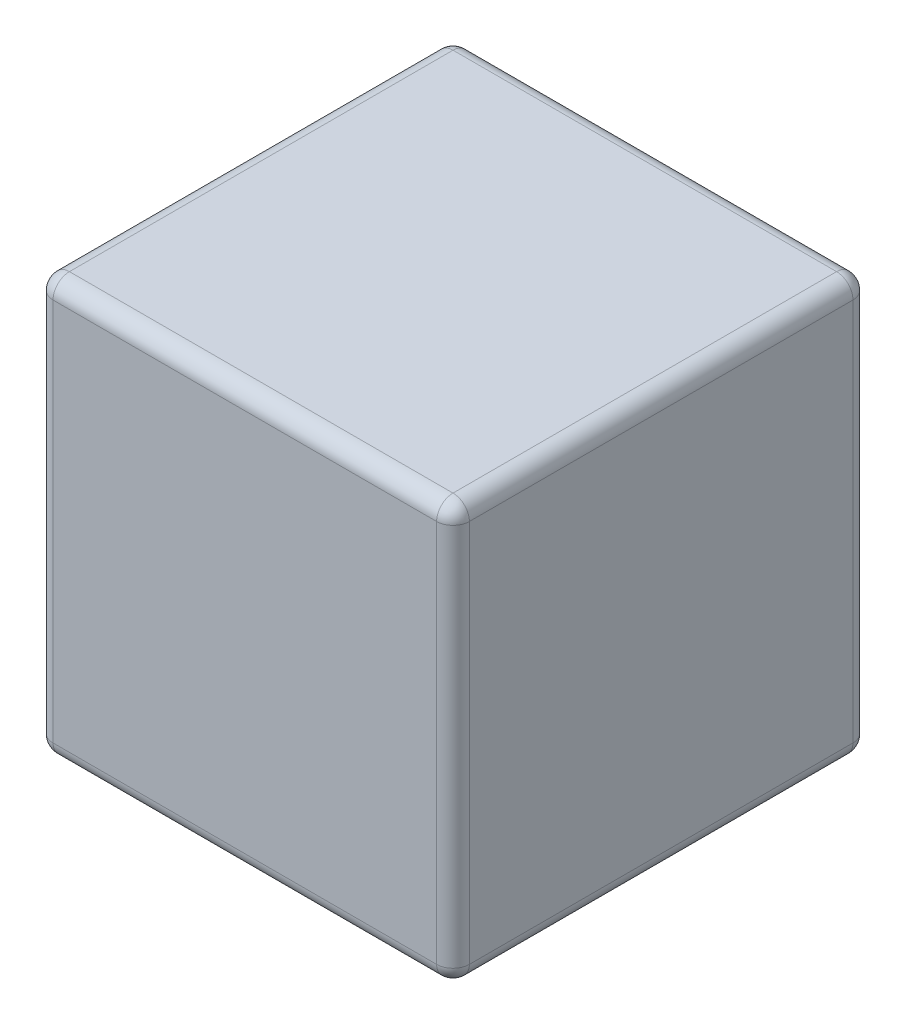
ISO-10303-21;
HEADER;
FILE_DESCRIPTION(('STEP AP214'),'2;1');
FILE_NAME('part.step','',(''),(''),'','','');
FILE_SCHEMA(('AUTOMOTIVE_DESIGN { 1 0 10303 214 1 1 1 1 }'));
ENDSEC;
DATA;
#1=APPLICATION_CONTEXT('core data for automotive mechanical design processes');
#2=APPLICATION_PROTOCOL_DEFINITION('international standard','automotive_design',2000,#1);
#3=PRODUCT_CONTEXT('',#1,'mechanical');
#4=PRODUCT('Part','Part','',(#3));
#5=PRODUCT_RELATED_PRODUCT_CATEGORY('part','',(#4));
#6=PRODUCT_DEFINITION_FORMATION('','',#4);
#7=PRODUCT_DEFINITION_CONTEXT('part definition',#1,'design');
#8=PRODUCT_DEFINITION('design','',#6,#7);
#9=PRODUCT_DEFINITION_SHAPE('','',#8);
#10=(LENGTH_UNIT() NAMED_UNIT(*) SI_UNIT(.MILLI.,.METRE.));
#11=(NAMED_UNIT(*) PLANE_ANGLE_UNIT() SI_UNIT($,.RADIAN.));
#12=(NAMED_UNIT(*) SI_UNIT($,.STERADIAN.) SOLID_ANGLE_UNIT());
#13=UNCERTAINTY_MEASURE_WITH_UNIT(LENGTH_MEASURE(1.E-05),#10,'distance_accuracy_value','');
#14=(GEOMETRIC_REPRESENTATION_CONTEXT(3) GLOBAL_UNCERTAINTY_ASSIGNED_CONTEXT((#13)) GLOBAL_UNIT_ASSIGNED_CONTEXT((#10,
#11,#12)) REPRESENTATION_CONTEXT('',''));
#15=CARTESIAN_POINT('',(0.,0.,0.));
#16=DIRECTION('',(0.,0.,1.));
#17=DIRECTION('',(1.,0.,0.));
#18=AXIS2_PLACEMENT_3D('',#15,#16,#17);
#19=CARTESIAN_POINT('',(12.7,25.4,12.7));
#20=DIRECTION('',(-1.,0.,0.));
#21=DIRECTION('',(0.,0.,1.));
#22=AXIS2_PLACEMENT_3D('',#19,#20,#21);
#23=PLANE('',#22);
#24=DIRECTION('',(0.,-1.,0.));
#25=VECTOR('',#24,1.);
#26=CARTESIAN_POINT('',(12.7,25.4,11.7));
#27=LINE('',#26,#25);
#28=CARTESIAN_POINT('',(12.7,24.4,11.7));
#29=VERTEX_POINT('',#28);
#30=CARTESIAN_POINT('',(12.7,1.,11.7));
#31=VERTEX_POINT('',#30);
#32=EDGE_CURVE('E135',#29,#31,#27,.T.);
#33=ORIENTED_EDGE('',*,*,#32,.T.);
#34=DIRECTION('',(0.,0.,-1.));
#35=VECTOR('',#34,1.);
#36=CARTESIAN_POINT('',(12.7,1.,-12.7));
#37=LINE('',#36,#35);
#38=CARTESIAN_POINT('',(12.7,1.,-11.7));
#39=VERTEX_POINT('',#38);
#40=EDGE_CURVE('E177',#31,#39,#37,.T.);
#41=ORIENTED_EDGE('',*,*,#40,.T.);
#42=DIRECTION('',(0.,-1.,0.));
#43=VECTOR('',#42,1.);
#44=CARTESIAN_POINT('',(12.7,25.4,-11.7));
#45=LINE('',#44,#43);
#46=CARTESIAN_POINT('',(12.7,24.4,-11.7));
#47=VERTEX_POINT('',#46);
#48=EDGE_CURVE('E138',#39,#47,#45,.F.);
#49=ORIENTED_EDGE('',*,*,#48,.T.);
#50=DIRECTION('',(0.,0.,-1.));
#51=VECTOR('',#50,1.);
#52=CARTESIAN_POINT('',(12.7,24.4,12.7));
#53=LINE('',#52,#51);
#54=EDGE_CURVE('E131',#47,#29,#53,.F.);
#55=ORIENTED_EDGE('',*,*,#54,.T.);
#56=EDGE_LOOP('',(#33,#41,#49,#55));
#57=FACE_BOUND('',#56,.T.);
#58=ADVANCED_FACE('F43',(#57),#23,.F.);
#59=CARTESIAN_POINT('',(-12.7,25.4,-12.7));
#60=DIRECTION('',(0.,0.,1.));
#61=DIRECTION('',(1.,0.,0.));
#62=AXIS2_PLACEMENT_3D('',#59,#60,#61);
#63=PLANE('',#62);
#64=DIRECTION('',(-1.,0.,0.));
#65=VECTOR('',#64,1.);
#66=CARTESIAN_POINT('',(-12.7,24.4,-12.7));
#67=LINE('',#66,#65);
#68=CARTESIAN_POINT('',(-11.7,24.4,-12.7));
#69=VERTEX_POINT('',#68);
#70=CARTESIAN_POINT('',(11.7,24.4,-12.7));
#71=VERTEX_POINT('',#70);
#72=EDGE_CURVE('E193',#69,#71,#67,.F.);
#73=ORIENTED_EDGE('',*,*,#72,.T.);
#74=DIRECTION('',(0.,-1.,0.));
#75=VECTOR('',#74,1.);
#76=CARTESIAN_POINT('',(11.7,25.4,-12.7));
#77=LINE('',#76,#75);
#78=CARTESIAN_POINT('',(11.7,1.,-12.7));
#79=VERTEX_POINT('',#78);
#80=EDGE_CURVE('E202',#71,#79,#77,.T.);
#81=ORIENTED_EDGE('',*,*,#80,.T.);
#82=DIRECTION('',(-1.,0.,0.));
#83=VECTOR('',#82,1.);
#84=CARTESIAN_POINT('',(-12.7,1.,-12.7));
#85=LINE('',#84,#83);
#86=CARTESIAN_POINT('',(-11.7,1.,-12.7));
#87=VERTEX_POINT('',#86);
#88=EDGE_CURVE('E199',#79,#87,#85,.T.);
#89=ORIENTED_EDGE('',*,*,#88,.T.);
#90=DIRECTION('',(0.,-1.,0.));
#91=VECTOR('',#90,1.);
#92=CARTESIAN_POINT('',(-11.7,25.4,-12.7));
#93=LINE('',#92,#91);
#94=EDGE_CURVE('E196',#87,#69,#93,.F.);
#95=ORIENTED_EDGE('',*,*,#94,.T.);
#96=EDGE_LOOP('',(#73,#81,#89,#95));
#97=FACE_BOUND('',#96,.T.);
#98=ADVANCED_FACE('F322',(#97),#63,.F.);
#99=CARTESIAN_POINT('',(-12.7,25.4,12.7));
#100=DIRECTION('',(1.,0.,0.));
#101=DIRECTION('',(0.,0.,-1.));
#102=AXIS2_PLACEMENT_3D('',#99,#100,#101);
#103=PLANE('',#102);
#104=DIRECTION('',(0.,0.,1.));
#105=VECTOR('',#104,1.);
#106=CARTESIAN_POINT('',(-12.7,24.4,12.7));
#107=LINE('',#106,#105);
#108=CARTESIAN_POINT('',(-12.7,24.4,11.7));
#109=VERTEX_POINT('',#108);
#110=CARTESIAN_POINT('',(-12.7,24.4,-11.7));
#111=VERTEX_POINT('',#110);
#112=EDGE_CURVE('E209',#109,#111,#107,.F.);
#113=ORIENTED_EDGE('',*,*,#112,.T.);
#114=DIRECTION('',(0.,-1.,0.));
#115=VECTOR('',#114,1.);
#116=CARTESIAN_POINT('',(-12.7,25.4,-11.7));
#117=LINE('',#116,#115);
#118=CARTESIAN_POINT('',(-12.7,1.,-11.7));
#119=VERTEX_POINT('',#118);
#120=EDGE_CURVE('E215',#111,#119,#117,.T.);
#121=ORIENTED_EDGE('',*,*,#120,.T.);
#122=DIRECTION('',(0.,0.,1.));
#123=VECTOR('',#122,1.);
#124=CARTESIAN_POINT('',(-12.7,1.,12.7));
#125=LINE('',#124,#123);
#126=CARTESIAN_POINT('',(-12.7,1.,11.7));
#127=VERTEX_POINT('',#126);
#128=EDGE_CURVE('E212',#119,#127,#125,.T.);
#129=ORIENTED_EDGE('',*,*,#128,.T.);
#130=DIRECTION('',(0.,-1.,0.));
#131=VECTOR('',#130,1.);
#132=CARTESIAN_POINT('',(-12.7,25.4,11.7));
#133=LINE('',#132,#131);
#134=EDGE_CURVE('E206',#127,#109,#133,.F.);
#135=ORIENTED_EDGE('',*,*,#134,.T.);
#136=EDGE_LOOP('',(#113,#121,#129,#135));
#137=FACE_BOUND('',#136,.T.);
#138=ADVANCED_FACE('F331',(#137),#103,.F.);
#139=CARTESIAN_POINT('',(-12.7,25.4,12.7));
#140=DIRECTION('',(0.,0.,-1.));
#141=DIRECTION('',(-1.,0.,0.));
#142=AXIS2_PLACEMENT_3D('',#139,#140,#141);
#143=PLANE('',#142);
#144=DIRECTION('',(1.,0.,0.));
#145=VECTOR('',#144,1.);
#146=CARTESIAN_POINT('',(-12.7,24.4,12.7));
#147=LINE('',#146,#145);
#148=CARTESIAN_POINT('',(11.7,24.4,12.7));
#149=VERTEX_POINT('',#148);
#150=CARTESIAN_POINT('',(-11.7,24.4,12.7));
#151=VERTEX_POINT('',#150);
#152=EDGE_CURVE('E53',#149,#151,#147,.F.);
#153=ORIENTED_EDGE('',*,*,#152,.T.);
#154=DIRECTION('',(0.,-1.,0.));
#155=VECTOR('',#154,1.);
#156=CARTESIAN_POINT('',(-11.7,25.4,12.7));
#157=LINE('',#156,#155);
#158=CARTESIAN_POINT('',(-11.7,1.,12.7));
#159=VERTEX_POINT('',#158);
#160=EDGE_CURVE('E11',#151,#159,#157,.T.);
#161=ORIENTED_EDGE('',*,*,#160,.T.);
#162=DIRECTION('',(1.,0.,0.));
#163=VECTOR('',#162,1.);
#164=CARTESIAN_POINT('',(12.7,1.,12.7));
#165=LINE('',#164,#163);
#166=CARTESIAN_POINT('',(11.7,1.,12.7));
#167=VERTEX_POINT('',#166);
#168=EDGE_CURVE('E231',#159,#167,#165,.T.);
#169=ORIENTED_EDGE('',*,*,#168,.T.);
#170=DIRECTION('',(0.,-1.,0.));
#171=VECTOR('',#170,1.);
#172=CARTESIAN_POINT('',(11.7,25.4,12.7));
#173=LINE('',#172,#171);
#174=EDGE_CURVE('E64',#167,#149,#173,.F.);
#175=ORIENTED_EDGE('',*,*,#174,.T.);
#176=EDGE_LOOP('',(#153,#161,#169,#175));
#177=FACE_BOUND('',#176,.T.);
#178=ADVANCED_FACE('F343',(#177),#143,.F.);
#179=CARTESIAN_POINT('',(0.,25.4,0.));
#180=DIRECTION('',(0.,-1.,0.));
#181=DIRECTION('',(0.,0.,-1.));
#182=AXIS2_PLACEMENT_3D('',#179,#180,#181);
#183=PLANE('',#182);
#184=DIRECTION('',(-1.,0.,0.));
#185=VECTOR('',#184,1.);
#186=CARTESIAN_POINT('',(0.,25.4,-11.7));
#187=LINE('',#186,#185);
#188=CARTESIAN_POINT('',(11.7,25.4,-11.7));
#189=VERTEX_POINT('',#188);
#190=CARTESIAN_POINT('',(-11.7,25.4,-11.7));
#191=VERTEX_POINT('',#190);
#192=EDGE_CURVE('E224',#189,#191,#187,.T.);
#193=ORIENTED_EDGE('',*,*,#192,.T.);
#194=DIRECTION('',(0.,0.,1.));
#195=VECTOR('',#194,1.);
#196=CARTESIAN_POINT('',(-11.7,25.4,0.));
#197=LINE('',#196,#195);
#198=CARTESIAN_POINT('',(-11.7,25.4,11.7));
#199=VERTEX_POINT('',#198);
#200=EDGE_CURVE('E227',#191,#199,#197,.T.);
#201=ORIENTED_EDGE('',*,*,#200,.T.);
#202=DIRECTION('',(1.,0.,0.));
#203=VECTOR('',#202,1.);
#204=CARTESIAN_POINT('',(0.,25.4,11.7));
#205=LINE('',#204,#203);
#206=CARTESIAN_POINT('',(11.7,25.4,11.7));
#207=VERTEX_POINT('',#206);
#208=EDGE_CURVE('E219',#199,#207,#205,.T.);
#209=ORIENTED_EDGE('',*,*,#208,.T.);
#210=DIRECTION('',(0.,0.,-1.));
#211=VECTOR('',#210,1.);
#212=CARTESIAN_POINT('',(11.7,25.4,0.));
#213=LINE('',#212,#211);
#214=EDGE_CURVE('E149',#207,#189,#213,.T.);
#215=ORIENTED_EDGE('',*,*,#214,.T.);
#216=EDGE_LOOP('',(#193,#201,#209,#215));
#217=FACE_BOUND('',#216,.T.);
#218=ADVANCED_FACE('F576',(#217),#183,.F.);
#219=CARTESIAN_POINT('',(0.,0.,0.));
#220=DIRECTION('',(0.,-1.,0.));
#221=DIRECTION('',(0.,0.,-1.));
#222=AXIS2_PLACEMENT_3D('',#219,#220,#221);
#223=PLANE('',#222);
#224=DIRECTION('',(-1.,0.,0.));
#225=VECTOR('',#224,1.);
#226=CARTESIAN_POINT('',(12.7,0.,-11.7));
#227=LINE('',#226,#225);
#228=CARTESIAN_POINT('',(-11.7,0.,-11.7));
#229=VERTEX_POINT('',#228);
#230=CARTESIAN_POINT('',(11.7,0.,-11.7));
#231=VERTEX_POINT('',#230);
#232=EDGE_CURVE('E186',#229,#231,#227,.F.);
#233=ORIENTED_EDGE('',*,*,#232,.T.);
#234=DIRECTION('',(0.,0.,-1.));
#235=VECTOR('',#234,1.);
#236=CARTESIAN_POINT('',(11.7,0.,12.7));
#237=LINE('',#236,#235);
#238=CARTESIAN_POINT('',(11.7,0.,11.7));
#239=VERTEX_POINT('',#238);
#240=EDGE_CURVE('E189',#231,#239,#237,.F.);
#241=ORIENTED_EDGE('',*,*,#240,.T.);
#242=DIRECTION('',(1.,0.,0.));
#243=VECTOR('',#242,1.);
#244=CARTESIAN_POINT('',(-12.7,0.,11.7));
#245=LINE('',#244,#243);
#246=CARTESIAN_POINT('',(-11.7,0.,11.7));
#247=VERTEX_POINT('',#246);
#248=EDGE_CURVE('E180',#239,#247,#245,.F.);
#249=ORIENTED_EDGE('',*,*,#248,.T.);
#250=DIRECTION('',(0.,0.,1.));
#251=VECTOR('',#250,1.);
#252=CARTESIAN_POINT('',(-11.7,0.,-12.7));
#253=LINE('',#252,#251);
#254=EDGE_CURVE('E183',#247,#229,#253,.F.);
#255=ORIENTED_EDGE('',*,*,#254,.T.);
#256=EDGE_LOOP('',(#233,#241,#249,#255));
#257=FACE_BOUND('',#256,.T.);
#258=ADVANCED_FACE('F567',(#257),#223,.T.);
#259=CARTESIAN_POINT('',(-11.7,24.4,0.));
#260=DIRECTION('',(0.,0.,1.));
#261=DIRECTION('',(1.,0.,0.));
#262=AXIS2_PLACEMENT_3D('',#259,#260,#261);
#263=CYLINDRICAL_SURFACE('',#262,1.);
#264=CARTESIAN_POINT('',(-11.7,24.4,11.7));
#265=DIRECTION('',(0.,0.,1.));
#266=DIRECTION('',(1.,0.,0.));
#267=AXIS2_PLACEMENT_3D('',#264,#265,#266);
#268=CIRCLE('',#267,1.);
#269=EDGE_CURVE('E47',#199,#109,#268,.T.);
#270=ORIENTED_EDGE('',*,*,#269,.F.);
#271=ORIENTED_EDGE('',*,*,#200,.F.);
#272=CARTESIAN_POINT('',(-11.7,24.4,-11.7));
#273=DIRECTION('',(0.,0.,-1.));
#274=DIRECTION('',(-1.,0.,0.));
#275=AXIS2_PLACEMENT_3D('',#272,#273,#274);
#276=CIRCLE('',#275,1.);
#277=EDGE_CURVE('E173',#111,#191,#276,.T.);
#278=ORIENTED_EDGE('',*,*,#277,.F.);
#279=ORIENTED_EDGE('',*,*,#112,.F.);
#280=EDGE_LOOP('',(#270,#271,#278,#279));
#281=FACE_BOUND('',#280,.T.);
#282=ADVANCED_FACE('F45',(#281),#263,.T.);
#283=CARTESIAN_POINT('',(-11.7,24.4,11.7));
#284=DIRECTION('',(-1.,0.,0.));
#285=DIRECTION('',(0.,0.,1.));
#286=AXIS2_PLACEMENT_3D('',#283,#284,#285);
#287=SPHERICAL_SURFACE('',#286,1.);
#288=CARTESIAN_POINT('',(-11.7,24.4,11.7));
#289=DIRECTION('',(-1.,0.,0.));
#290=DIRECTION('',(0.,0.,1.));
#291=AXIS2_PLACEMENT_3D('',#288,#289,#290);
#292=CIRCLE('',#291,1.);
#293=EDGE_CURVE('E298',#199,#151,#292,.F.);
#294=ORIENTED_EDGE('',*,*,#293,.F.);
#295=ORIENTED_EDGE('',*,*,#269,.T.);
#296=CARTESIAN_POINT('',(-11.7,24.4,11.7));
#297=DIRECTION('',(0.,1.,0.));
#298=DIRECTION('',(0.,0.,1.));
#299=AXIS2_PLACEMENT_3D('',#296,#297,#298);
#300=CIRCLE('',#299,1.);
#301=EDGE_CURVE('E301',#151,#109,#300,.F.);
#302=ORIENTED_EDGE('',*,*,#301,.F.);
#303=EDGE_LOOP('',(#294,#295,#302));
#304=FACE_BOUND('',#303,.T.);
#305=ADVANCED_FACE('F337',(#304),#287,.T.);
#306=CARTESIAN_POINT('',(-11.7,24.4,-11.7));
#307=DIRECTION('',(0.,1.,0.));
#308=DIRECTION('',(0.,0.,1.));
#309=AXIS2_PLACEMENT_3D('',#306,#307,#308);
#310=SPHERICAL_SURFACE('',#309,1.);
#311=CARTESIAN_POINT('',(-11.7,24.4,-11.7));
#312=DIRECTION('',(0.,1.,0.));
#313=DIRECTION('',(0.,0.,1.));
#314=AXIS2_PLACEMENT_3D('',#311,#312,#313);
#315=CIRCLE('',#314,1.);
#316=EDGE_CURVE('E290',#111,#69,#315,.F.);
#317=ORIENTED_EDGE('',*,*,#316,.F.);
#318=ORIENTED_EDGE('',*,*,#277,.T.);
#319=CARTESIAN_POINT('',(-11.7,24.4,-11.7));
#320=DIRECTION('',(-1.,0.,0.));
#321=DIRECTION('',(0.,0.,1.));
#322=AXIS2_PLACEMENT_3D('',#319,#320,#321);
#323=CIRCLE('',#322,1.);
#324=EDGE_CURVE('E294',#69,#191,#323,.F.);
#325=ORIENTED_EDGE('',*,*,#324,.F.);
#326=EDGE_LOOP('',(#317,#318,#325));
#327=FACE_BOUND('',#326,.T.);
#328=ADVANCED_FACE('F310',(#327),#310,.T.);
#329=CARTESIAN_POINT('',(-11.7,25.4,11.7));
#330=DIRECTION('',(0.,-1.,0.));
#331=DIRECTION('',(0.,0.,-1.));
#332=AXIS2_PLACEMENT_3D('',#329,#330,#331);
#333=CYLINDRICAL_SURFACE('',#332,1.);
#334=ORIENTED_EDGE('',*,*,#301,.T.);
#335=ORIENTED_EDGE('',*,*,#134,.F.);
#336=CARTESIAN_POINT('',(-11.7,1.,11.7));
#337=DIRECTION('',(0.,-1.,0.));
#338=DIRECTION('',(0.,0.,-1.));
#339=AXIS2_PLACEMENT_3D('',#336,#337,#338);
#340=CIRCLE('',#339,1.);
#341=EDGE_CURVE('E282',#159,#127,#340,.T.);
#342=ORIENTED_EDGE('',*,*,#341,.F.);
#343=ORIENTED_EDGE('',*,*,#160,.F.);
#344=EDGE_LOOP('',(#334,#335,#342,#343));
#345=FACE_BOUND('',#344,.T.);
#346=ADVANCED_FACE('F340',(#345),#333,.T.);
#347=CARTESIAN_POINT('',(0.,24.4,11.7));
#348=DIRECTION('',(1.,0.,0.));
#349=DIRECTION('',(0.,0.,-1.));
#350=AXIS2_PLACEMENT_3D('',#347,#348,#349);
#351=CYLINDRICAL_SURFACE('',#350,1.);
#352=ORIENTED_EDGE('',*,*,#293,.T.);
#353=ORIENTED_EDGE('',*,*,#152,.F.);
#354=CARTESIAN_POINT('',(11.7,24.4,11.7));
#355=DIRECTION('',(1.,0.,0.));
#356=DIRECTION('',(0.,0.,-1.));
#357=AXIS2_PLACEMENT_3D('',#354,#355,#356);
#358=CIRCLE('',#357,1.);
#359=EDGE_CURVE('E154',#207,#149,#358,.T.);
#360=ORIENTED_EDGE('',*,*,#359,.F.);
#361=ORIENTED_EDGE('',*,*,#208,.F.);
#362=EDGE_LOOP('',(#352,#353,#360,#361));
#363=FACE_BOUND('',#362,.T.);
#364=ADVANCED_FACE('F521',(#363),#351,.T.);
#365=CARTESIAN_POINT('',(11.7,24.4,0.));
#366=DIRECTION('',(0.,0.,-1.));
#367=DIRECTION('',(-1.,0.,0.));
#368=AXIS2_PLACEMENT_3D('',#365,#366,#367);
#369=CYLINDRICAL_SURFACE('',#368,1.);
#370=CARTESIAN_POINT('',(11.7,24.4,-11.7));
#371=DIRECTION('',(0.,0.,-1.));
#372=DIRECTION('',(-1.,0.,0.));
#373=AXIS2_PLACEMENT_3D('',#370,#371,#372);
#374=CIRCLE('',#373,1.);
#375=EDGE_CURVE('E155',#189,#47,#374,.T.);
#376=ORIENTED_EDGE('',*,*,#375,.F.);
#377=ORIENTED_EDGE('',*,*,#214,.F.);
#378=CARTESIAN_POINT('',(11.7,24.4,11.7));
#379=DIRECTION('',(0.,0.,1.));
#380=DIRECTION('',(1.,0.,0.));
#381=AXIS2_PLACEMENT_3D('',#378,#379,#380);
#382=CIRCLE('',#381,1.);
#383=EDGE_CURVE('E146',#29,#207,#382,.T.);
#384=ORIENTED_EDGE('',*,*,#383,.F.);
#385=ORIENTED_EDGE('',*,*,#54,.F.);
#386=EDGE_LOOP('',(#376,#377,#384,#385));
#387=FACE_BOUND('',#386,.T.);
#388=ADVANCED_FACE('F148',(#387),#369,.T.);
#389=CARTESIAN_POINT('',(0.,24.4,-11.7));
#390=DIRECTION('',(-1.,0.,0.));
#391=DIRECTION('',(0.,0.,1.));
#392=AXIS2_PLACEMENT_3D('',#389,#390,#391);
#393=CYLINDRICAL_SURFACE('',#392,1.);
#394=ORIENTED_EDGE('',*,*,#324,.T.);
#395=ORIENTED_EDGE('',*,*,#192,.F.);
#396=CARTESIAN_POINT('',(11.7,24.4,-11.7));
#397=DIRECTION('',(1.,0.,0.));
#398=DIRECTION('',(0.,0.,-1.));
#399=AXIS2_PLACEMENT_3D('',#396,#397,#398);
#400=CIRCLE('',#399,1.);
#401=EDGE_CURVE('E274',#71,#189,#400,.T.);
#402=ORIENTED_EDGE('',*,*,#401,.F.);
#403=ORIENTED_EDGE('',*,*,#72,.F.);
#404=EDGE_LOOP('',(#394,#395,#402,#403));
#405=FACE_BOUND('',#404,.T.);
#406=ADVANCED_FACE('F318',(#405),#393,.T.);
#407=CARTESIAN_POINT('',(-11.7,25.4,-11.7));
#408=DIRECTION('',(0.,-1.,0.));
#409=DIRECTION('',(0.,0.,-1.));
#410=AXIS2_PLACEMENT_3D('',#407,#408,#409);
#411=CYLINDRICAL_SURFACE('',#410,1.);
#412=ORIENTED_EDGE('',*,*,#316,.T.);
#413=ORIENTED_EDGE('',*,*,#94,.F.);
#414=CARTESIAN_POINT('',(-11.7,1.,-11.7));
#415=DIRECTION('',(0.,-1.,0.));
#416=DIRECTION('',(0.,0.,-1.));
#417=AXIS2_PLACEMENT_3D('',#414,#415,#416);
#418=CIRCLE('',#417,1.);
#419=EDGE_CURVE('E270',#119,#87,#418,.T.);
#420=ORIENTED_EDGE('',*,*,#419,.F.);
#421=ORIENTED_EDGE('',*,*,#120,.F.);
#422=EDGE_LOOP('',(#412,#413,#420,#421));
#423=FACE_BOUND('',#422,.T.);
#424=ADVANCED_FACE('F328',(#423),#411,.T.);
#425=CARTESIAN_POINT('',(-11.7,1.,12.7));
#426=DIRECTION('',(0.,0.,-1.));
#427=DIRECTION('',(-1.,0.,0.));
#428=AXIS2_PLACEMENT_3D('',#425,#426,#427);
#429=CYLINDRICAL_SURFACE('',#428,1.);
#430=CARTESIAN_POINT('',(-11.7,1.,11.7));
#431=DIRECTION('',(0.,0.,1.));
#432=DIRECTION('',(1.,0.,0.));
#433=AXIS2_PLACEMENT_3D('',#430,#431,#432);
#434=CIRCLE('',#433,1.);
#435=EDGE_CURVE('E286',#127,#247,#434,.T.);
#436=ORIENTED_EDGE('',*,*,#435,.F.);
#437=ORIENTED_EDGE('',*,*,#128,.F.);
#438=CARTESIAN_POINT('',(-11.7,1.,-11.7));
#439=DIRECTION('',(0.,0.,-1.));
#440=DIRECTION('',(-1.,0.,0.));
#441=AXIS2_PLACEMENT_3D('',#438,#439,#440);
#442=CIRCLE('',#441,1.);
#443=EDGE_CURVE('E267',#229,#119,#442,.T.);
#444=ORIENTED_EDGE('',*,*,#443,.F.);
#445=ORIENTED_EDGE('',*,*,#254,.F.);
#446=EDGE_LOOP('',(#436,#437,#444,#445));
#447=FACE_BOUND('',#446,.T.);
#448=ADVANCED_FACE('F482',(#447),#429,.T.);
#449=CARTESIAN_POINT('',(-11.7,1.,11.7));
#450=DIRECTION('',(-1.,0.,0.));
#451=DIRECTION('',(0.,-1.,0.));
#452=AXIS2_PLACEMENT_3D('',#449,#450,#451);
#453=SPHERICAL_SURFACE('',#452,1.);
#454=ORIENTED_EDGE('',*,*,#341,.T.);
#455=ORIENTED_EDGE('',*,*,#435,.T.);
#456=CARTESIAN_POINT('',(-11.7,1.,11.7));
#457=DIRECTION('',(-1.,0.,0.));
#458=DIRECTION('',(0.,0.,1.));
#459=AXIS2_PLACEMENT_3D('',#456,#457,#458);
#460=CIRCLE('',#459,1.);
#461=EDGE_CURVE('E162',#159,#247,#460,.F.);
#462=ORIENTED_EDGE('',*,*,#461,.F.);
#463=EDGE_LOOP('',(#454,#455,#462));
#464=FACE_BOUND('',#463,.T.);
#465=ADVANCED_FACE('F373',(#464),#453,.T.);
#466=CARTESIAN_POINT('',(11.7,24.4,11.7));
#467=DIRECTION('',(0.,1.,0.));
#468=DIRECTION('',(0.,0.,1.));
#469=AXIS2_PLACEMENT_3D('',#466,#467,#468);
#470=SPHERICAL_SURFACE('',#469,1.);
#471=ORIENTED_EDGE('',*,*,#383,.T.);
#472=ORIENTED_EDGE('',*,*,#359,.T.);
#473=CARTESIAN_POINT('',(11.7,24.4,11.7));
#474=DIRECTION('',(0.,1.,0.));
#475=DIRECTION('',(0.,0.,1.));
#476=AXIS2_PLACEMENT_3D('',#473,#474,#475);
#477=CIRCLE('',#476,1.);
#478=EDGE_CURVE('E158',#29,#149,#477,.F.);
#479=ORIENTED_EDGE('',*,*,#478,.F.);
#480=EDGE_LOOP('',(#471,#472,#479));
#481=FACE_BOUND('',#480,.T.);
#482=ADVANCED_FACE('F159',(#481),#470,.T.);
#483=CARTESIAN_POINT('',(11.7,24.4,-11.7));
#484=DIRECTION('',(0.,1.,0.));
#485=DIRECTION('',(0.,0.,1.));
#486=AXIS2_PLACEMENT_3D('',#483,#484,#485);
#487=SPHERICAL_SURFACE('',#486,1.);
#488=ORIENTED_EDGE('',*,*,#401,.T.);
#489=ORIENTED_EDGE('',*,*,#375,.T.);
#490=CARTESIAN_POINT('',(11.7,24.4,-11.7));
#491=DIRECTION('',(0.,1.,0.));
#492=DIRECTION('',(0.,0.,1.));
#493=AXIS2_PLACEMENT_3D('',#490,#491,#492);
#494=CIRCLE('',#493,1.);
#495=EDGE_CURVE('E163',#71,#47,#494,.F.);
#496=ORIENTED_EDGE('',*,*,#495,.F.);
#497=EDGE_LOOP('',(#488,#489,#496));
#498=FACE_BOUND('',#497,.T.);
#499=ADVANCED_FACE('F363',(#498),#487,.T.);
#500=CARTESIAN_POINT('',(-11.7,1.,-11.7));
#501=DIRECTION('',(-1.,0.,0.));
#502=DIRECTION('',(0.,-1.,0.));
#503=AXIS2_PLACEMENT_3D('',#500,#501,#502);
#504=SPHERICAL_SURFACE('',#503,1.);
#505=ORIENTED_EDGE('',*,*,#443,.T.);
#506=ORIENTED_EDGE('',*,*,#419,.T.);
#507=CARTESIAN_POINT('',(-11.7,1.,-11.7));
#508=DIRECTION('',(-1.,0.,0.));
#509=DIRECTION('',(0.,0.,1.));
#510=AXIS2_PLACEMENT_3D('',#507,#508,#509);
#511=CIRCLE('',#510,1.);
#512=EDGE_CURVE('E257',#229,#87,#511,.F.);
#513=ORIENTED_EDGE('',*,*,#512,.F.);
#514=EDGE_LOOP('',(#505,#506,#513));
#515=FACE_BOUND('',#514,.T.);
#516=ADVANCED_FACE('F365',(#515),#504,.T.);
#517=CARTESIAN_POINT('',(-12.7,1.,11.7));
#518=DIRECTION('',(-1.,0.,0.));
#519=DIRECTION('',(0.,0.,1.));
#520=AXIS2_PLACEMENT_3D('',#517,#518,#519);
#521=CYLINDRICAL_SURFACE('',#520,1.);
#522=ORIENTED_EDGE('',*,*,#461,.T.);
#523=ORIENTED_EDGE('',*,*,#248,.F.);
#524=CARTESIAN_POINT('',(11.7,1.,11.7));
#525=DIRECTION('',(1.,0.,0.));
#526=DIRECTION('',(0.,0.,-1.));
#527=AXIS2_PLACEMENT_3D('',#524,#525,#526);
#528=CIRCLE('',#527,1.);
#529=EDGE_CURVE('E253',#167,#239,#528,.T.);
#530=ORIENTED_EDGE('',*,*,#529,.F.);
#531=ORIENTED_EDGE('',*,*,#168,.F.);
#532=EDGE_LOOP('',(#522,#523,#530,#531));
#533=FACE_BOUND('',#532,.T.);
#534=ADVANCED_FACE('F348',(#533),#521,.T.);
#535=CARTESIAN_POINT('',(11.7,25.4,11.7));
#536=DIRECTION('',(0.,-1.,0.));
#537=DIRECTION('',(0.,0.,-1.));
#538=AXIS2_PLACEMENT_3D('',#535,#536,#537);
#539=CYLINDRICAL_SURFACE('',#538,1.);
#540=ORIENTED_EDGE('',*,*,#478,.T.);
#541=ORIENTED_EDGE('',*,*,#174,.F.);
#542=CARTESIAN_POINT('',(11.7,1.,11.7));
#543=DIRECTION('',(0.,-1.,0.));
#544=DIRECTION('',(0.,0.,-1.));
#545=AXIS2_PLACEMENT_3D('',#542,#543,#544);
#546=CIRCLE('',#545,1.);
#547=EDGE_CURVE('E167',#31,#167,#546,.T.);
#548=ORIENTED_EDGE('',*,*,#547,.F.);
#549=ORIENTED_EDGE('',*,*,#32,.F.);
#550=EDGE_LOOP('',(#540,#541,#548,#549));
#551=FACE_BOUND('',#550,.T.);
#552=ADVANCED_FACE('F165',(#551),#539,.T.);
#553=CARTESIAN_POINT('',(11.7,25.4,-11.7));
#554=DIRECTION('',(0.,-1.,0.));
#555=DIRECTION('',(0.,0.,-1.));
#556=AXIS2_PLACEMENT_3D('',#553,#554,#555);
#557=CYLINDRICAL_SURFACE('',#556,1.);
#558=ORIENTED_EDGE('',*,*,#495,.T.);
#559=ORIENTED_EDGE('',*,*,#48,.F.);
#560=CARTESIAN_POINT('',(11.7,1.,-11.7));
#561=DIRECTION('',(0.,-1.,0.));
#562=DIRECTION('',(0.,0.,-1.));
#563=AXIS2_PLACEMENT_3D('',#560,#561,#562);
#564=CIRCLE('',#563,1.);
#565=EDGE_CURVE('E247',#79,#39,#564,.T.);
#566=ORIENTED_EDGE('',*,*,#565,.F.);
#567=ORIENTED_EDGE('',*,*,#80,.F.);
#568=EDGE_LOOP('',(#558,#559,#566,#567));
#569=FACE_BOUND('',#568,.T.);
#570=ADVANCED_FACE('F361',(#569),#557,.T.);
#571=CARTESIAN_POINT('',(-12.7,1.,-11.7));
#572=DIRECTION('',(1.,0.,0.));
#573=DIRECTION('',(0.,0.,-1.));
#574=AXIS2_PLACEMENT_3D('',#571,#572,#573);
#575=CYLINDRICAL_SURFACE('',#574,1.);
#576=ORIENTED_EDGE('',*,*,#512,.T.);
#577=ORIENTED_EDGE('',*,*,#88,.F.);
#578=CARTESIAN_POINT('',(11.7,1.,-11.7));
#579=DIRECTION('',(1.,0.,0.));
#580=DIRECTION('',(0.,0.,-1.));
#581=AXIS2_PLACEMENT_3D('',#578,#579,#580);
#582=CIRCLE('',#581,1.);
#583=EDGE_CURVE('E244',#231,#79,#582,.T.);
#584=ORIENTED_EDGE('',*,*,#583,.F.);
#585=ORIENTED_EDGE('',*,*,#232,.F.);
#586=EDGE_LOOP('',(#576,#577,#584,#585));
#587=FACE_BOUND('',#586,.T.);
#588=ADVANCED_FACE('F389',(#587),#575,.T.);
#589=CARTESIAN_POINT('',(11.7,1.,11.7));
#590=DIRECTION('',(0.,0.,1.));
#591=DIRECTION('',(0.,-1.,0.));
#592=AXIS2_PLACEMENT_3D('',#589,#590,#591);
#593=SPHERICAL_SURFACE('',#592,1.);
#594=ORIENTED_EDGE('',*,*,#547,.T.);
#595=ORIENTED_EDGE('',*,*,#529,.T.);
#596=CARTESIAN_POINT('',(11.7,1.,11.7));
#597=DIRECTION('',(0.,0.,1.));
#598=DIRECTION('',(1.,0.,0.));
#599=AXIS2_PLACEMENT_3D('',#596,#597,#598);
#600=CIRCLE('',#599,1.);
#601=EDGE_CURVE('E241',#31,#239,#600,.F.);
#602=ORIENTED_EDGE('',*,*,#601,.F.);
#603=EDGE_LOOP('',(#594,#595,#602));
#604=FACE_BOUND('',#603,.T.);
#605=ADVANCED_FACE('F350',(#604),#593,.T.);
#606=CARTESIAN_POINT('',(11.7,1.,-11.7));
#607=DIRECTION('',(0.,0.,-1.));
#608=DIRECTION('',(0.,1.,0.));
#609=AXIS2_PLACEMENT_3D('',#606,#607,#608);
#610=SPHERICAL_SURFACE('',#609,1.);
#611=ORIENTED_EDGE('',*,*,#583,.T.);
#612=ORIENTED_EDGE('',*,*,#565,.T.);
#613=CARTESIAN_POINT('',(11.7,1.,-11.7));
#614=DIRECTION('',(0.,0.,-1.));
#615=DIRECTION('',(-1.,0.,0.));
#616=AXIS2_PLACEMENT_3D('',#613,#614,#615);
#617=CIRCLE('',#616,1.);
#618=EDGE_CURVE('E238',#231,#39,#617,.F.);
#619=ORIENTED_EDGE('',*,*,#618,.F.);
#620=EDGE_LOOP('',(#611,#612,#619));
#621=FACE_BOUND('',#620,.T.);
#622=ADVANCED_FACE('F358',(#621),#610,.T.);
#623=CARTESIAN_POINT('',(11.7,1.,12.7));
#624=DIRECTION('',(0.,0.,1.));
#625=DIRECTION('',(1.,0.,0.));
#626=AXIS2_PLACEMENT_3D('',#623,#624,#625);
#627=CYLINDRICAL_SURFACE('',#626,1.);
#628=ORIENTED_EDGE('',*,*,#601,.T.);
#629=ORIENTED_EDGE('',*,*,#240,.F.);
#630=ORIENTED_EDGE('',*,*,#618,.T.);
#631=ORIENTED_EDGE('',*,*,#40,.F.);
#632=EDGE_LOOP('',(#628,#629,#630,#631));
#633=FACE_BOUND('',#632,.T.);
#634=ADVANCED_FACE('F354',(#633),#627,.T.);
#635=CLOSED_SHELL('',(#58,#98,#138,#178,#218,#258,#282,#305,#328,#346,#364,#388,#406,#424,#448,
#465,#482,#499,#516,#534,#552,#570,#588,#605,#622,#634));
#636=MANIFOLD_SOLID_BREP('B2',#635);
#637=ADVANCED_BREP_SHAPE_REPRESENTATION('',(#18,#636),#14);
#638=SHAPE_DEFINITION_REPRESENTATION(#9,#637);
ENDSEC;
END-ISO-10303-21;
